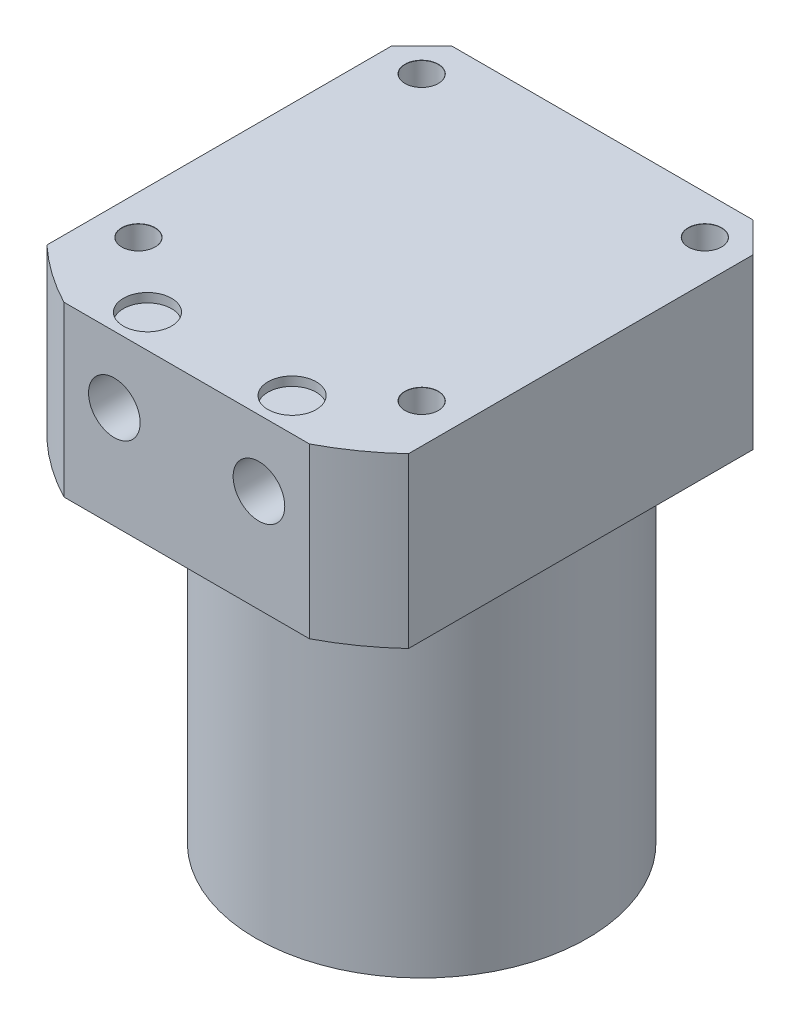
from build123d import *

# Parameters (mm, degrees)
SKETCH2_OUTSIDE_W                            = 120.37
SKETCH2_OUTSIDE_H                            = 120.37
SKETCH2_OUTSIDE_W_2                          = 60
SKETCH2_OUTSIDE_H_2                          = 69
CUT_EXTRUDE2_DEPTH                           = 107.96261029
CHAMFER1_SIZE                                = 5
F_8_0_8_DIAMETER_HOLE1_D                     = 8
F_8_0_8_DIAMETER_HOLE1_DEPTH                 = 1.5
G1_8_TAPPED_HOLE1_D                          = 8.566
G1_8_TAPPED_HOLE1_DEPTH                      = 22.18
CBORE_FOR_M5_HEX_SOCKET_HEAD_CAP_SCR_2_COUNT = 2
CBORE_FOR_M5_HEX_SOCKET_HEAD_CAP_SCR_2_PITCH = 47
CBORE_FOR_M5_HEX_SOCKET_HEAD_CAP_SCR_3_COUNT = 2
CBORE_FOR_M5_HEX_SOCKET_HEAD_CAP_SCR_3_PITCH = 66.468037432
CBORE_FOR_M5_HEX_SOCKET_HEAD_CAP_SCR_4_COUNT = 2
CBORE_FOR_M5_HEX_SOCKET_HEAD_CAP_SCR_4_PITCH = 47


with BuildPart() as part:
    # Sketch1 → Revolve1 (revolve)
    with BuildSketch(Plane.XY, mode=Mode.PRIVATE) as revolve1_sk:
        Polygon((0, 0), (-27.5, 0), (-27.5, 59), (-44, 59), (-44, 87), (0, 87), align=None)
    revolve(revolve1_sk.sketch.rotate(Axis((0, 87.050829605, 0), (0, -1, 0)), 270), axis=Axis((0, 87.050829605, 0), (0, -1, 0)))

    # Sketch2 outside → Cut-Extrude2 (cut, through all)
    with BuildSketch(Plane(origin=(0, 87, 0), x_dir=(1, 0, 0), z_dir=(0, 1, 0))):
        Rectangle(SKETCH2_OUTSIDE_W, SKETCH2_OUTSIDE_H)
        with Locations((0, -4.5)):
            Rectangle(SKETCH2_OUTSIDE_W_2, SKETCH2_OUTSIDE_H_2, mode=Mode.SUBTRACT)
    extrude(amount=-CUT_EXTRUDE2_DEPTH, mode=Mode.SUBTRACT)

    # Chamfer1
    chamfer1_edges = [part.edges().sort_by_distance(p)[0] for p in [
        (-30, 73, -30),
        (30, 73, -30),
    ]]
    chamfer(chamfer1_edges, length=CHAMFER1_SIZE)

    # 8.0 _8_ Diameter Hole1
    with Locations(Plane(origin=(-22.940510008, 87, 22.705104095), x_dir=(1, 0, 0), z_dir=(0, 1, 0))):
        with Locations((10.940510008, -10.794895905), (34.940510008, -10.794895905)):
            Hole(F_8_0_8_DIAMETER_HOLE1_D / 2, depth=F_8_0_8_DIAMETER_HOLE1_DEPTH)

    # G1_8 Tapped Hole1
    with Locations(Plane.XY.offset(39)):
        with Locations((-12, 76), (12, 76)):
            Hole(G1_8_TAPPED_HOLE1_D / 2, depth=G1_8_TAPPED_HOLE1_DEPTH)

    # Sketch7 → CBORE for M5 Hex Socket Head Cap Screw1 (revolve, cut)
    with BuildSketch(Plane(origin=(-23.5, 59, -23.5), x_dir=(0, 0, -1), z_dir=(1, 0, 0))):
        Polygon((0, 0), (0, 28), (2.775, 28), (2.75, 27.975), (2.75, 5), (5, 5), (5, 0), align=None)
    cbore_for_m5_hex_socket_head_cap_screw1 = revolve(axis=Axis((-23.5, 52.65, -23.5), (0, 1, 0)), mode=Mode.SUBTRACT)

    # CBORE for M5 Hex Socket Head Cap Scr 2: CBORE for M5 Hex Socket Head Cap Screw1 ×2
    with Locations(*[(i * CBORE_FOR_M5_HEX_SOCKET_HEAD_CAP_SCR_2_PITCH, 0, 0) for i in range(1, CBORE_FOR_M5_HEX_SOCKET_HEAD_CAP_SCR_2_COUNT)]):
        add(cbore_for_m5_hex_socket_head_cap_screw1, mode=Mode.SUBTRACT)

    # CBORE for M5 Hex Socket Head Cap Scr 3: CBORE for M5 Hex Socket Head Cap Screw1 ×2
    with Locations(*[Vector(0.7071067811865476, 0, 0.7071067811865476) * (i * CBORE_FOR_M5_HEX_SOCKET_HEAD_CAP_SCR_3_PITCH) for i in range(1, CBORE_FOR_M5_HEX_SOCKET_HEAD_CAP_SCR_3_COUNT)]):
        add(cbore_for_m5_hex_socket_head_cap_screw1, mode=Mode.SUBTRACT)

    # CBORE for M5 Hex Socket Head Cap Scr 4: CBORE for M5 Hex Socket Head Cap Screw1 ×2
    with Locations(*[(0, 0, i * CBORE_FOR_M5_HEX_SOCKET_HEAD_CAP_SCR_4_PITCH) for i in range(1, CBORE_FOR_M5_HEX_SOCKET_HEAD_CAP_SCR_4_COUNT)]):
        add(cbore_for_m5_hex_socket_head_cap_screw1, mode=Mode.SUBTRACT)


solid = part.part
